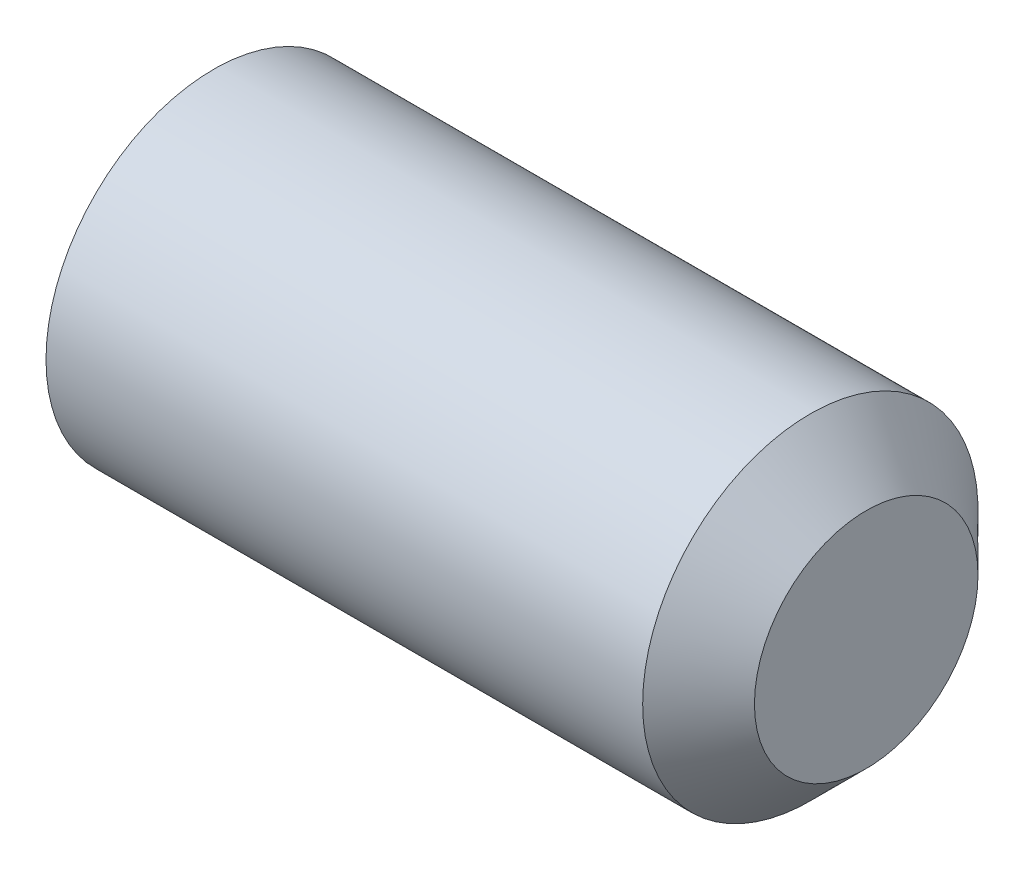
ISO-10303-21;
HEADER;
FILE_DESCRIPTION(('STEP AP214'),'2;1');
FILE_NAME('part.step','',(''),(''),'','','');
FILE_SCHEMA(('AUTOMOTIVE_DESIGN { 1 0 10303 214 1 1 1 1 }'));
ENDSEC;
DATA;
#1=APPLICATION_CONTEXT('core data for automotive mechanical design processes');
#2=APPLICATION_PROTOCOL_DEFINITION('international standard','automotive_design',2000,#1);
#3=PRODUCT_CONTEXT('',#1,'mechanical');
#4=PRODUCT('Part','Part','',(#3));
#5=PRODUCT_RELATED_PRODUCT_CATEGORY('part','',(#4));
#6=PRODUCT_DEFINITION_FORMATION('','',#4);
#7=PRODUCT_DEFINITION_CONTEXT('part definition',#1,'design');
#8=PRODUCT_DEFINITION('design','',#6,#7);
#9=PRODUCT_DEFINITION_SHAPE('','',#8);
#10=(LENGTH_UNIT() NAMED_UNIT(*) SI_UNIT(.MILLI.,.METRE.));
#11=(NAMED_UNIT(*) PLANE_ANGLE_UNIT() SI_UNIT($,.RADIAN.));
#12=(NAMED_UNIT(*) SI_UNIT($,.STERADIAN.) SOLID_ANGLE_UNIT());
#13=UNCERTAINTY_MEASURE_WITH_UNIT(LENGTH_MEASURE(1.E-05),#10,'distance_accuracy_value','');
#14=(GEOMETRIC_REPRESENTATION_CONTEXT(3) GLOBAL_UNCERTAINTY_ASSIGNED_CONTEXT((#13)) GLOBAL_UNIT_ASSIGNED_CONTEXT((#10,
#11,#12)) REPRESENTATION_CONTEXT('',''));
#15=CARTESIAN_POINT('',(0.,0.,0.));
#16=DIRECTION('',(0.,0.,1.));
#17=DIRECTION('',(1.,0.,0.));
#18=AXIS2_PLACEMENT_3D('',#15,#16,#17);
#19=CARTESIAN_POINT('',(0.,0.,0.));
#20=DIRECTION('',(-1.,0.,0.));
#21=DIRECTION('',(0.,0.,1.));
#22=AXIS2_PLACEMENT_3D('',#19,#20,#21);
#23=PLANE('',#22);
#24=CARTESIAN_POINT('',(0.,0.,0.));
#25=DIRECTION('',(-1.,0.,0.));
#26=DIRECTION('',(0.,0.,1.));
#27=AXIS2_PLACEMENT_3D('',#24,#25,#26);
#28=CIRCLE('',#27,1.2195);
#29=CARTESIAN_POINT('',(0.,0.,1.2195));
#30=VERTEX_POINT('',#29);
#31=EDGE_CURVE('E138',#30,#30,#28,.T.);
#32=ORIENTED_EDGE('',*,*,#31,.T.);
#33=EDGE_LOOP('',(#32));
#34=FACE_BOUND('',#33,.T.);
#35=DIRECTION('',(0.,0.,-1.));
#36=VECTOR('',#35,1.);
#37=CARTESIAN_POINT('',(0.,0.750000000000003,0.433012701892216));
#38=LINE('',#37,#36);
#39=CARTESIAN_POINT('',(0.,0.750000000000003,0.433012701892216));
#40=VERTEX_POINT('',#39);
#41=CARTESIAN_POINT('',(0.,0.750000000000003,-0.433012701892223));
#42=VERTEX_POINT('',#41);
#43=EDGE_CURVE('E129',#40,#42,#38,.T.);
#44=ORIENTED_EDGE('',*,*,#43,.F.);
#45=DIRECTION('',(0.,-0.866025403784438,0.5));
#46=VECTOR('',#45,1.);
#47=CARTESIAN_POINT('',(0.,0.750000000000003,0.433012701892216));
#48=LINE('',#47,#46);
#49=CARTESIAN_POINT('',(0.,0.,0.866025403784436));
#50=VERTEX_POINT('',#49);
#51=EDGE_CURVE('E51',#40,#50,#48,.T.);
#52=ORIENTED_EDGE('',*,*,#51,.T.);
#53=DIRECTION('',(0.,0.866025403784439,0.5));
#54=VECTOR('',#53,1.);
#55=CARTESIAN_POINT('',(0.,-0.749999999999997,0.433012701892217));
#56=LINE('',#55,#54);
#57=CARTESIAN_POINT('',(0.,-0.749999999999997,0.433012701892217));
#58=VERTEX_POINT('',#57);
#59=EDGE_CURVE('E120',#58,#50,#56,.T.);
#60=ORIENTED_EDGE('',*,*,#59,.F.);
#61=DIRECTION('',(0.,0.,-1.));
#62=VECTOR('',#61,1.);
#63=CARTESIAN_POINT('',(0.,-0.749999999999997,0.433012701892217));
#64=LINE('',#63,#62);
#65=CARTESIAN_POINT('',(0.,-0.749999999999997,-0.433012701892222));
#66=VERTEX_POINT('',#65);
#67=EDGE_CURVE('E123',#58,#66,#64,.T.);
#68=ORIENTED_EDGE('',*,*,#67,.T.);
#69=DIRECTION('',(0.,0.866025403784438,-0.500000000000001));
#70=VECTOR('',#69,1.);
#71=CARTESIAN_POINT('',(0.,-0.749999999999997,-0.433012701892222));
#72=LINE('',#71,#70);
#73=CARTESIAN_POINT('',(0.,0.,-0.866025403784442));
#74=VERTEX_POINT('',#73);
#75=EDGE_CURVE('E126',#66,#74,#72,.T.);
#76=ORIENTED_EDGE('',*,*,#75,.T.);
#77=DIRECTION('',(0.,-0.866025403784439,-0.5));
#78=VECTOR('',#77,1.);
#79=CARTESIAN_POINT('',(0.,0.750000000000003,-0.433012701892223));
#80=LINE('',#79,#78);
#81=EDGE_CURVE('E109',#42,#74,#80,.T.);
#82=ORIENTED_EDGE('',*,*,#81,.F.);
#83=EDGE_LOOP('',(#44,#52,#60,#68,#76,#82));
#84=FACE_BOUND('',#83,.T.);
#85=ADVANCED_FACE('F36',(#34,#84),#23,.T.);
#86=CARTESIAN_POINT('',(6.,1.,0.));
#87=DIRECTION('',(1.,0.,0.));
#88=DIRECTION('',(0.,0.,-1.));
#89=AXIS2_PLACEMENT_3D('',#86,#87,#88);
#90=PLANE('',#89);
#91=CARTESIAN_POINT('',(6.,0.,0.));
#92=DIRECTION('',(-1.,0.,0.));
#93=DIRECTION('',(0.,0.,1.));
#94=AXIS2_PLACEMENT_3D('',#91,#92,#93);
#95=CIRCLE('',#94,1.);
#96=CARTESIAN_POINT('',(6.,0.,1.));
#97=VERTEX_POINT('',#96);
#98=EDGE_CURVE('E11',#97,#97,#95,.T.);
#99=ORIENTED_EDGE('',*,*,#98,.F.);
#100=EDGE_LOOP('',(#99));
#101=FACE_BOUND('',#100,.T.);
#102=ADVANCED_FACE('F38',(#101),#90,.T.);
#103=CARTESIAN_POINT('',(5.5,0.,0.));
#104=DIRECTION('',(-1.,0.,0.));
#105=DIRECTION('',(0.,0.,1.));
#106=AXIS2_PLACEMENT_3D('',#103,#104,#105);
#107=CONICAL_SURFACE('',#106,1.5,0.785398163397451);
#108=ORIENTED_EDGE('',*,*,#98,.T.);
#109=EDGE_LOOP('',(#108));
#110=FACE_BOUND('',#109,.T.);
#111=CARTESIAN_POINT('',(5.5,0.,0.));
#112=DIRECTION('',(-1.,0.,0.));
#113=DIRECTION('',(0.,0.,1.));
#114=AXIS2_PLACEMENT_3D('',#111,#112,#113);
#115=CIRCLE('',#114,1.5);
#116=CARTESIAN_POINT('',(5.5,0.,1.5));
#117=VERTEX_POINT('',#116);
#118=EDGE_CURVE('E44',#117,#117,#115,.T.);
#119=ORIENTED_EDGE('',*,*,#118,.F.);
#120=EDGE_LOOP('',(#119));
#121=FACE_BOUND('',#120,.T.);
#122=ADVANCED_FACE('F149',(#110,#121),#107,.T.);
#123=CARTESIAN_POINT('',(-12.7,0.,0.));
#124=DIRECTION('',(-1.,0.,0.));
#125=DIRECTION('',(0.,0.,1.));
#126=AXIS2_PLACEMENT_3D('',#123,#124,#125);
#127=CYLINDRICAL_SURFACE('',#126,1.5);
#128=ORIENTED_EDGE('',*,*,#118,.T.);
#129=EDGE_LOOP('',(#128));
#130=FACE_BOUND('',#129,.T.);
#131=CARTESIAN_POINT('',(0.161946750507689,0.,0.));
#132=DIRECTION('',(-1.,0.,0.));
#133=DIRECTION('',(0.,0.,1.));
#134=AXIS2_PLACEMENT_3D('',#131,#132,#133);
#135=CIRCLE('',#134,1.5);
#136=CARTESIAN_POINT('',(0.161946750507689,0.,1.5));
#137=VERTEX_POINT('',#136);
#138=EDGE_CURVE('E141',#137,#137,#135,.T.);
#139=ORIENTED_EDGE('',*,*,#138,.F.);
#140=EDGE_LOOP('',(#139));
#141=FACE_BOUND('',#140,.T.);
#142=ADVANCED_FACE('F146',(#130,#141),#127,.T.);
#143=CARTESIAN_POINT('',(0.,0.,0.));
#144=DIRECTION('',(1.,0.,0.));
#145=DIRECTION('',(0.,0.,-1.));
#146=AXIS2_PLACEMENT_3D('',#143,#144,#145);
#147=CONICAL_SURFACE('',#146,1.2195,1.0471975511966);
#148=ORIENTED_EDGE('',*,*,#138,.T.);
#149=EDGE_LOOP('',(#148));
#150=FACE_BOUND('',#149,.T.);
#151=ORIENTED_EDGE('',*,*,#31,.F.);
#152=EDGE_LOOP('',(#151));
#153=FACE_BOUND('',#152,.T.);
#154=ADVANCED_FACE('F156',(#150,#153),#147,.T.);
#155=CARTESIAN_POINT('',(2.1,0.750000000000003,0.433012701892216));
#156=DIRECTION('',(0.,-0.5,-0.866025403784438));
#157=DIRECTION('',(0.,0.866025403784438,-0.5));
#158=AXIS2_PLACEMENT_3D('',#155,#156,#157);
#159=PLANE('',#158);
#160=ORIENTED_EDGE('',*,*,#51,.F.);
#161=DIRECTION('',(-1.,0.,0.));
#162=VECTOR('',#161,1.);
#163=CARTESIAN_POINT('',(2.1,0.750000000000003,0.433012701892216));
#164=LINE('',#163,#162);
#165=CARTESIAN_POINT('',(2.1,0.750000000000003,0.433012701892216));
#166=VERTEX_POINT('',#165);
#167=EDGE_CURVE('E56',#166,#40,#164,.T.);
#168=ORIENTED_EDGE('',*,*,#167,.F.);
#169=DIRECTION('',(0.,-0.866025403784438,0.5));
#170=VECTOR('',#169,1.);
#171=CARTESIAN_POINT('',(2.1,0.750000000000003,0.433012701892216));
#172=LINE('',#171,#170);
#173=CARTESIAN_POINT('',(2.1,0.,0.866025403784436));
#174=VERTEX_POINT('',#173);
#175=EDGE_CURVE('E83',#166,#174,#172,.T.);
#176=ORIENTED_EDGE('',*,*,#175,.T.);
#177=DIRECTION('',(-1.,0.,0.));
#178=VECTOR('',#177,1.);
#179=CARTESIAN_POINT('',(2.1,0.,0.866025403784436));
#180=LINE('',#179,#178);
#181=EDGE_CURVE('E136',#174,#50,#180,.T.);
#182=ORIENTED_EDGE('',*,*,#181,.T.);
#183=EDGE_LOOP('',(#160,#168,#176,#182));
#184=FACE_BOUND('',#183,.T.);
#185=ADVANCED_FACE('F167',(#184),#159,.T.);
#186=CARTESIAN_POINT('',(2.1,-0.749999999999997,0.433012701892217));
#187=DIRECTION('',(0.,-0.5,0.866025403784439));
#188=DIRECTION('',(0.,-0.866025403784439,-0.5));
#189=AXIS2_PLACEMENT_3D('',#186,#187,#188);
#190=PLANE('',#189);
#191=ORIENTED_EDGE('',*,*,#59,.T.);
#192=ORIENTED_EDGE('',*,*,#181,.F.);
#193=DIRECTION('',(0.,0.866025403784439,0.5));
#194=VECTOR('',#193,1.);
#195=CARTESIAN_POINT('',(2.1,-0.749999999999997,0.433012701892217));
#196=LINE('',#195,#194);
#197=CARTESIAN_POINT('',(2.1,-0.749999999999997,0.433012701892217));
#198=VERTEX_POINT('',#197);
#199=EDGE_CURVE('E269',#198,#174,#196,.T.);
#200=ORIENTED_EDGE('',*,*,#199,.F.);
#201=DIRECTION('',(-1.,0.,0.));
#202=VECTOR('',#201,1.);
#203=CARTESIAN_POINT('',(2.1,-0.749999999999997,0.433012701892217));
#204=LINE('',#203,#202);
#205=EDGE_CURVE('E134',#198,#58,#204,.T.);
#206=ORIENTED_EDGE('',*,*,#205,.T.);
#207=EDGE_LOOP('',(#191,#192,#200,#206));
#208=FACE_BOUND('',#207,.T.);
#209=ADVANCED_FACE('F174',(#208),#190,.F.);
#210=CARTESIAN_POINT('',(2.1,-0.749999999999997,0.433012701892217));
#211=DIRECTION('',(0.,1.,0.));
#212=DIRECTION('',(0.,0.,1.));
#213=AXIS2_PLACEMENT_3D('',#210,#211,#212);
#214=PLANE('',#213);
#215=ORIENTED_EDGE('',*,*,#67,.F.);
#216=ORIENTED_EDGE('',*,*,#205,.F.);
#217=DIRECTION('',(0.,0.,-1.));
#218=VECTOR('',#217,1.);
#219=CARTESIAN_POINT('',(2.1,-0.749999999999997,0.433012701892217));
#220=LINE('',#219,#218);
#221=CARTESIAN_POINT('',(2.1,-0.749999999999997,-0.433012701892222));
#222=VERTEX_POINT('',#221);
#223=EDGE_CURVE('E104',#198,#222,#220,.T.);
#224=ORIENTED_EDGE('',*,*,#223,.T.);
#225=DIRECTION('',(-1.,0.,0.));
#226=VECTOR('',#225,1.);
#227=CARTESIAN_POINT('',(2.1,-0.749999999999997,-0.433012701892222));
#228=LINE('',#227,#226);
#229=EDGE_CURVE('E99',#222,#66,#228,.T.);
#230=ORIENTED_EDGE('',*,*,#229,.T.);
#231=EDGE_LOOP('',(#215,#216,#224,#230));
#232=FACE_BOUND('',#231,.T.);
#233=ADVANCED_FACE('F181',(#232),#214,.T.);
#234=CARTESIAN_POINT('',(2.1,-0.749999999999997,-0.433012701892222));
#235=DIRECTION('',(0.,0.500000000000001,0.866025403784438));
#236=DIRECTION('',(0.,-0.866025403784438,0.500000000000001));
#237=AXIS2_PLACEMENT_3D('',#234,#235,#236);
#238=PLANE('',#237);
#239=ORIENTED_EDGE('',*,*,#75,.F.);
#240=ORIENTED_EDGE('',*,*,#229,.F.);
#241=DIRECTION('',(0.,0.866025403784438,-0.500000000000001));
#242=VECTOR('',#241,1.);
#243=CARTESIAN_POINT('',(2.1,-0.749999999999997,-0.433012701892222));
#244=LINE('',#243,#242);
#245=CARTESIAN_POINT('',(2.1,0.,-0.866025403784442));
#246=VERTEX_POINT('',#245);
#247=EDGE_CURVE('E94',#222,#246,#244,.T.);
#248=ORIENTED_EDGE('',*,*,#247,.T.);
#249=DIRECTION('',(-1.,0.,0.));
#250=VECTOR('',#249,1.);
#251=CARTESIAN_POINT('',(2.1,0.,-0.866025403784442));
#252=LINE('',#251,#250);
#253=EDGE_CURVE('E98',#246,#74,#252,.T.);
#254=ORIENTED_EDGE('',*,*,#253,.T.);
#255=EDGE_LOOP('',(#239,#240,#248,#254));
#256=FACE_BOUND('',#255,.T.);
#257=ADVANCED_FACE('F97',(#256),#238,.T.);
#258=CARTESIAN_POINT('',(2.1,0.750000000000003,-0.433012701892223));
#259=DIRECTION('',(0.,0.5,-0.866025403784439));
#260=DIRECTION('',(0.,0.866025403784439,0.5));
#261=AXIS2_PLACEMENT_3D('',#258,#259,#260);
#262=PLANE('',#261);
#263=ORIENTED_EDGE('',*,*,#81,.T.);
#264=ORIENTED_EDGE('',*,*,#253,.F.);
#265=DIRECTION('',(0.,-0.866025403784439,-0.5));
#266=VECTOR('',#265,1.);
#267=CARTESIAN_POINT('',(2.1,0.750000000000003,-0.433012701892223));
#268=LINE('',#267,#266);
#269=CARTESIAN_POINT('',(2.1,0.750000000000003,-0.433012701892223));
#270=VERTEX_POINT('',#269);
#271=EDGE_CURVE('E103',#270,#246,#268,.T.);
#272=ORIENTED_EDGE('',*,*,#271,.F.);
#273=DIRECTION('',(-1.,0.,0.));
#274=VECTOR('',#273,1.);
#275=CARTESIAN_POINT('',(2.1,0.750000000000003,-0.433012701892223));
#276=LINE('',#275,#274);
#277=EDGE_CURVE('E79',#270,#42,#276,.T.);
#278=ORIENTED_EDGE('',*,*,#277,.T.);
#279=EDGE_LOOP('',(#263,#264,#272,#278));
#280=FACE_BOUND('',#279,.T.);
#281=ADVANCED_FACE('F106',(#280),#262,.F.);
#282=CARTESIAN_POINT('',(2.1,0.750000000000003,0.433012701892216));
#283=DIRECTION('',(0.,1.,0.));
#284=DIRECTION('',(0.,0.,1.));
#285=AXIS2_PLACEMENT_3D('',#282,#283,#284);
#286=PLANE('',#285);
#287=ORIENTED_EDGE('',*,*,#43,.T.);
#288=ORIENTED_EDGE('',*,*,#277,.F.);
#289=DIRECTION('',(0.,0.,-1.));
#290=VECTOR('',#289,1.);
#291=CARTESIAN_POINT('',(2.1,0.750000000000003,0.433012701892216));
#292=LINE('',#291,#290);
#293=EDGE_CURVE('E114',#166,#270,#292,.T.);
#294=ORIENTED_EDGE('',*,*,#293,.F.);
#295=ORIENTED_EDGE('',*,*,#167,.T.);
#296=EDGE_LOOP('',(#287,#288,#294,#295));
#297=FACE_BOUND('',#296,.T.);
#298=ADVANCED_FACE('F193',(#297),#286,.F.);
#299=CARTESIAN_POINT('',(2.1,1.5,0.));
#300=DIRECTION('',(1.,0.,0.));
#301=DIRECTION('',(0.,0.,-1.));
#302=AXIS2_PLACEMENT_3D('',#299,#300,#301);
#303=PLANE('',#302);
#304=ORIENTED_EDGE('',*,*,#175,.F.);
#305=ORIENTED_EDGE('',*,*,#293,.T.);
#306=ORIENTED_EDGE('',*,*,#271,.T.);
#307=ORIENTED_EDGE('',*,*,#247,.F.);
#308=ORIENTED_EDGE('',*,*,#223,.F.);
#309=ORIENTED_EDGE('',*,*,#199,.T.);
#310=EDGE_LOOP('',(#304,#305,#306,#307,#308,#309));
#311=FACE_BOUND('',#310,.T.);
#312=ADVANCED_FACE('F112',(#311),#303,.F.);
#313=CLOSED_SHELL('',(#85,#102,#122,#142,#154,#185,#209,#233,#257,#281,#298,#312));
#314=MANIFOLD_SOLID_BREP('B2',#313);
#315=ADVANCED_BREP_SHAPE_REPRESENTATION('',(#18,#314),#14);
#316=SHAPE_DEFINITION_REPRESENTATION(#9,#315);
ENDSEC;
END-ISO-10303-21;
